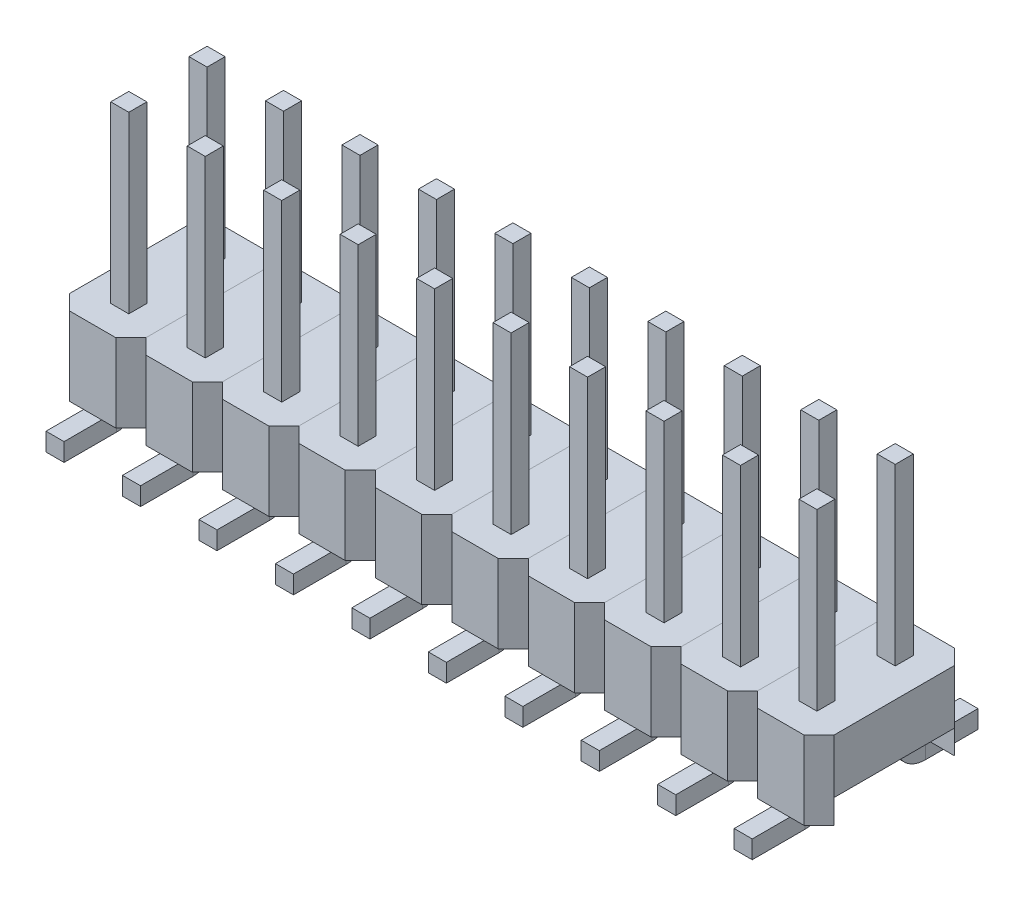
from build123d import *

# Parameters (mm, degrees)
SKETCH1_W             = 2.54
SKETCH1_H             = 5
BOSS_EXTRUDE1_DEPTH   = 2.6
CHAMFER1_SIZE         = 0.5
CUT_EXTRUDE1_REACH    = 5.824
SKETCH2_W             = 0.6
SKETCH2_H             = 0.6
CUT_EXTRUDE2_REACH    = 6.412
SKETCH3_W             = 4
SKETCH3_H             = 0.8
SKETCH4_W             = 0.6
SKETCH4_H             = 0.6
BOSS_EXTRUDE2_DEPTH   = 5.8
BOSS_EXTRUDE2_2_DEPTH = 5.8
SKETCH5_W             = 0.6
SKETCH5_H             = 0.6
SKETCH11_W            = 0.6
SKETCH11_H            = 0.6
LPATTERN1_COUNT       = 10
LPATTERN1_PITCH       = 2.54


with BuildPart() as part:
    # Sketch1 → Boss-Extrude1 (new body)
    with BuildSketch(Plane(origin=(0, 0, 0), x_dir=(1, 0, 0), z_dir=(0, 1, 0))):
        Rectangle(SKETCH1_W, SKETCH1_H)
    extrude(amount=BOSS_EXTRUDE1_DEPTH)

    # Chamfer1
    chamfer1_edges = [part.edges().sort_by_distance(p)[0] for p in [
        (1.27, 1.3, 2.5),
        (-1.27, 1.3, 2.5),
        (-1.27, 1.3, -2.5),
        (1.27, 1.3, -2.5),
    ]]
    chamfer(chamfer1_edges, length=CHAMFER1_SIZE)

    # Sketch2 → Cut-Extrude1 (cut, up to next)
    with BuildSketch(Plane(origin=(0, 2.6, 0), x_dir=(1, 0, 0), z_dir=(0, 1, 0)), mode=Mode.PRIVATE) as cut_extrude1_sk1:
        with Locations((0, 1.3)):
            Rectangle(SKETCH2_W, SKETCH2_H)
    cut_extrude1_tool1 = extrude(cut_extrude1_sk1.sketch, amount=-CUT_EXTRUDE1_REACH, mode=Mode.PRIVATE) & part.part
    # Sketch2 → Cut-Extrude1 (cut, up to next)
    with BuildSketch(Plane(origin=(0, 2.6, 0), x_dir=(1, 0, 0), z_dir=(0, 1, 0)), mode=Mode.PRIVATE) as cut_extrude1_sk2:
        with Locations((0, -1.3)):
            Rectangle(SKETCH2_W, SKETCH2_H)
    cut_extrude1_tool2 = extrude(cut_extrude1_sk2.sketch, amount=-CUT_EXTRUDE1_REACH, mode=Mode.PRIVATE) & part.part
    add(cut_extrude1_tool1.solids().sort_by_distance((0, 2.6, -1.3))[0], mode=Mode.SUBTRACT)
    add(cut_extrude1_tool2.solids().sort_by_distance((0, 2.6, 1.3))[0], mode=Mode.SUBTRACT)

    # Sketch3 → Cut-Extrude2 (cut, up to next)
    with BuildSketch(Plane(origin=(1.27, 0, 0), x_dir=(0, 0, -1), z_dir=(1, 0, 0)), mode=Mode.PRIVATE) as cut_extrude2_sk1:
        with Locations((0, 0.4)):
            Rectangle(SKETCH3_W, SKETCH3_H)
    cut_extrude2_tool1 = extrude(cut_extrude2_sk1.sketch, amount=-CUT_EXTRUDE2_REACH, mode=Mode.PRIVATE) & part.part
    add(cut_extrude2_tool1.solids().sort_by_distance((1.27, 0.4, 0))[0], mode=Mode.SUBTRACT)


with BuildPart() as body_2:
    # Sketch4 → Boss-Extrude2 (new body)
    with BuildSketch(Plane(origin=(0, 2.6, 0), x_dir=(1, 0, 0), z_dir=(0, 1, 0))):
        with Locations((0, -1.3)):
            Rectangle(SKETCH4_W, SKETCH4_H)
    extrude(amount=BOSS_EXTRUDE2_DEPTH)

    # Sweep2: sweep along a path in Sketch10
    with BuildLine(Plane(origin=(-0.3, 0, 0), x_dir=(0, 0, -1), z_dir=(1, 0, 0))) as sweep2_path:
        Line((-3.75, 0), (-2, 0))
        ThreePointArc((-2, 0), (-1.717157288, 0.117157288), (-1.6, 0.4))
        Line((-1.6, 0.4), (-1.6, 2.6))
    # Sketch11 → Sweep2 (sweep)
    with BuildSketch(Plane.XZ.offset(-2.6)):
        with Locations((0, 1.3)):
            Rectangle(SKETCH11_W, SKETCH11_H)
    sweep(path=sweep2_path.line)


with BuildPart() as body_3:
    # Sketch4 → Boss-Extrude2 2 (new body)
    with BuildSketch(Plane(origin=(0, 2.6, 0), x_dir=(1, 0, 0), z_dir=(0, 1, 0))):
        with Locations((0, 1.3)):
            Rectangle(SKETCH4_W, SKETCH4_H)
    extrude(amount=BOSS_EXTRUDE2_2_DEPTH)

    # Sweep1: sweep along a path in Sketch7
    with BuildLine(Plane(origin=(-0.3, 0, 0), x_dir=(0, 0, -1), z_dir=(1, 0, 0))) as sweep1_path:
        Line((1.6, 2.6), (1.6, 0.4))
        ThreePointArc((1.6, 0.4), (1.717157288, 0.117157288), (2, 0))
        Line((2, 0), (3.75, 0))
    # Sketch5 → Sweep1 (sweep)
    with BuildSketch(Plane.XZ.offset(-2.6)):
        with Locations((0, -1.3)):
            Rectangle(SKETCH5_W, SKETCH5_H)
    sweep(path=sweep1_path.line)


with BuildPart() as lpattern1_1:
    # LPattern1: pattern copy
    add(body_3.part.moved(Location(Vector(1, 0, 0) * (1 * LPATTERN1_PITCH))))


with BuildPart() as lpattern1_2:
    # LPattern1: pattern copy
    add(body_3.part.moved(Location(Vector(1, 0, 0) * (2 * LPATTERN1_PITCH))))


with BuildPart() as lpattern1_3:
    # LPattern1: pattern copy
    add(body_3.part.moved(Location(Vector(1, 0, 0) * (3 * LPATTERN1_PITCH))))


with BuildPart() as lpattern1_4:
    # LPattern1: pattern copy
    add(body_3.part.moved(Location(Vector(1, 0, 0) * (4 * LPATTERN1_PITCH))))


with BuildPart() as lpattern1_5:
    # LPattern1: pattern copy
    add(body_3.part.moved(Location(Vector(1, 0, 0) * (5 * LPATTERN1_PITCH))))


with BuildPart() as lpattern1_6:
    # LPattern1: pattern copy
    add(body_3.part.moved(Location(Vector(1, 0, 0) * (6 * LPATTERN1_PITCH))))


with BuildPart() as lpattern1_7:
    # LPattern1: pattern copy
    add(body_3.part.moved(Location(Vector(1, 0, 0) * (7 * LPATTERN1_PITCH))))


with BuildPart() as lpattern1_8:
    # LPattern1: pattern copy
    add(body_3.part.moved(Location(Vector(1, 0, 0) * (8 * LPATTERN1_PITCH))))


with BuildPart() as lpattern1_9:
    # LPattern1: pattern copy
    add(body_3.part.moved(Location(Vector(1, 0, 0) * (9 * LPATTERN1_PITCH))))


with BuildPart() as lpattern1_10:
    # LPattern1: pattern copy
    add(body_2.part.moved(Location(Vector(1, 0, 0) * (1 * LPATTERN1_PITCH))))


with BuildPart() as lpattern1_11:
    # LPattern1: pattern copy
    add(body_2.part.moved(Location(Vector(1, 0, 0) * (2 * LPATTERN1_PITCH))))


with BuildPart() as lpattern1_12:
    # LPattern1: pattern copy
    add(body_2.part.moved(Location(Vector(1, 0, 0) * (3 * LPATTERN1_PITCH))))


with BuildPart() as lpattern1_13:
    # LPattern1: pattern copy
    add(body_2.part.moved(Location(Vector(1, 0, 0) * (4 * LPATTERN1_PITCH))))


with BuildPart() as lpattern1_14:
    # LPattern1: pattern copy
    add(body_2.part.moved(Location(Vector(1, 0, 0) * (5 * LPATTERN1_PITCH))))


with BuildPart() as lpattern1_15:
    # LPattern1: pattern copy
    add(body_2.part.moved(Location(Vector(1, 0, 0) * (6 * LPATTERN1_PITCH))))


with BuildPart() as lpattern1_16:
    # LPattern1: pattern copy
    add(body_2.part.moved(Location(Vector(1, 0, 0) * (7 * LPATTERN1_PITCH))))


with BuildPart() as lpattern1_17:
    # LPattern1: pattern copy
    add(body_2.part.moved(Location(Vector(1, 0, 0) * (8 * LPATTERN1_PITCH))))


with BuildPart() as lpattern1_18:
    # LPattern1: pattern copy
    add(body_2.part.moved(Location(Vector(1, 0, 0) * (9 * LPATTERN1_PITCH))))


with BuildPart() as lpattern1_19:
    # LPattern1: pattern copy
    add(part.part.moved(Location(Vector(1, 0, 0) * (1 * LPATTERN1_PITCH))))


with BuildPart() as lpattern1_20:
    # LPattern1: pattern copy
    add(part.part.moved(Location(Vector(1, 0, 0) * (2 * LPATTERN1_PITCH))))


with BuildPart() as lpattern1_21:
    # LPattern1: pattern copy
    add(part.part.moved(Location(Vector(1, 0, 0) * (3 * LPATTERN1_PITCH))))


with BuildPart() as lpattern1_22:
    # LPattern1: pattern copy
    add(part.part.moved(Location(Vector(1, 0, 0) * (4 * LPATTERN1_PITCH))))


with BuildPart() as lpattern1_23:
    # LPattern1: pattern copy
    add(part.part.moved(Location(Vector(1, 0, 0) * (5 * LPATTERN1_PITCH))))


with BuildPart() as lpattern1_24:
    # LPattern1: pattern copy
    add(part.part.moved(Location(Vector(1, 0, 0) * (6 * LPATTERN1_PITCH))))


with BuildPart() as lpattern1_25:
    # LPattern1: pattern copy
    add(part.part.moved(Location(Vector(1, 0, 0) * (7 * LPATTERN1_PITCH))))


with BuildPart() as lpattern1_26:
    # LPattern1: pattern copy
    add(part.part.moved(Location(Vector(1, 0, 0) * (8 * LPATTERN1_PITCH))))


with BuildPart() as lpattern1_27:
    # LPattern1: pattern copy
    add(part.part.moved(Location(Vector(1, 0, 0) * (9 * LPATTERN1_PITCH))))


solid = Compound([part.part, body_2.part, body_3.part, lpattern1_1.part, lpattern1_2.part, lpattern1_3.part, lpattern1_4.part, lpattern1_5.part, lpattern1_6.part, lpattern1_7.part, lpattern1_8.part, lpattern1_9.part, lpattern1_10.part, lpattern1_11.part, lpattern1_12.part, lpattern1_13.part, lpattern1_14.part, lpattern1_15.part, lpattern1_16.part, lpattern1_17.part, lpattern1_18.part, lpattern1_19.part, lpattern1_20.part, lpattern1_21.part, lpattern1_22.part, lpattern1_23.part, lpattern1_24.part, lpattern1_25.part, lpattern1_26.part, lpattern1_27.part])
